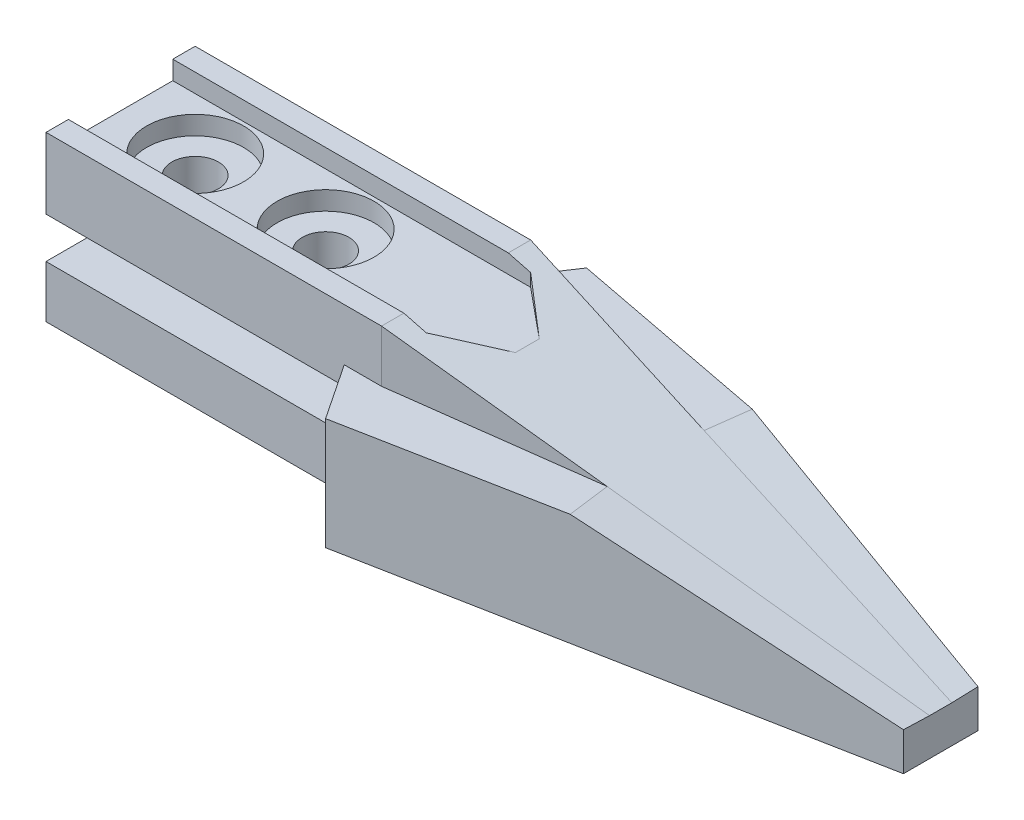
from build123d import *

# Parameters (mm, degrees)
EXTRUDE_1_DEPTH     = 20
CUT_EXTRUDE_1_DEPTH = 5
SKETCH_3_R          = 6.25
CUT_EXTRUDE_2_DEPTH = 225.323427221
SKETCH_4_R          = 13
CUT_EXTRUDE_3_DEPTH = 5
CUT_EXTRUDE_START   = -5
SKETCH_5_R          = 13
CUT_EXTRUDE_4_DEPTH = 5
CUT_EXTRUDE_6_DEPTH = 226.246531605
EXTRUDE_2_DEPTH     = 30
CUT_EXTRUDE_7_DEPTH = 227.231075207


with BuildPart() as part:
    # Sketch 1 → Extrude 1 (new, symmetric)
    with BuildSketch(Plane.XY):
        Polygon((0, 0), (90, 0), (220, -34), (220, -44), (0, -44), (0, -30), (80, -30), (80, -19), (0, -19), align=None)
    extrude(amount=EXTRUDE_1_DEPTH, both=True)

    # Sketch 2 → Cut-Extrude 1 (cut)
    with BuildSketch(Plane(origin=(0, 0, 0), x_dir=(-1, 0, 0), z_dir=(0, 1, 0))):
        Polygon((0, -14), (-96, -14), (-113, 0), (-96, 14), (0, 14), align=None)
    extrude(amount=-CUT_EXTRUDE_1_DEPTH, mode=Mode.SUBTRACT)

    # Sketch 3 → Cut-Extrude 2 (cut, through all)
    with BuildSketch(Plane(origin=(0, -5, 0), x_dir=(-1, 0, 0), z_dir=(0, 1, 0))):
        with Locations(Location((-20, 0, 0), (0, 0, 90))):
            Circle(SKETCH_3_R)
        with Locations(Location((-55, 0, 0), (0, 0, 90))):
            Circle(SKETCH_3_R)
    extrude(amount=-CUT_EXTRUDE_2_DEPTH, mode=Mode.SUBTRACT)

    # Sketch 4 → Cut-Extrude 3 (cut)
    with BuildSketch(Plane(origin=(0, -5, 0), x_dir=(-1, 0, 0), z_dir=(0, 1, 0))):
        with Locations(Location((-55, 0, 0), (0, 0, 90))):
            Circle(SKETCH_4_R)
        with Locations(Location((-20, 0, 0), (0, 0, 90))):
            Circle(SKETCH_4_R)
    extrude(amount=-CUT_EXTRUDE_3_DEPTH, mode=Mode.SUBTRACT)

    # Sketch 5 → Cut-Extrude 4 (cut)
    with BuildSketch(Plane.XZ.offset(44).offset(CUT_EXTRUDE_START)):
        with Locations(Location((20, 0, 0), (0, 0, 90))):
            Circle(SKETCH_5_R)
        with Locations(Location((55, 0, 0), (0, 0, 90))):
            Circle(SKETCH_5_R)
    extrude(amount=CUT_EXTRUDE_4_DEPTH, mode=Mode.SUBTRACT)

    # Sketch 8 → Cut-Extrude 6 (cut, through all)
    with BuildSketch(Plane(origin=(0, 0, 0), x_dir=(-1, 0, 0), z_dir=(0, 1, 0))):
        Polygon((-90, -20), (-220, -3), (-220, -20), align=None)
        Polygon((-90, 20), (-220, 20), (-220, 3), align=None)
    extrude(amount=-CUT_EXTRUDE_6_DEPTH, mode=Mode.SUBTRACT)

    # Sketch 9 → Extrude 2 (add)
    with BuildSketch(Plane.XZ.offset(44)):
        Polygon((80, -20), (90, -35), (220, -10), (220, -3), (90, -20), align=None)
    extrude_2 = extrude(amount=-EXTRUDE_2_DEPTH)

    # Sketch 10 → Cut-Extrude 7 (cut, through all)
    with BuildSketch(Plane(origin=(4.084588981, 0, -31.23509221), x_dir=(0.9915578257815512, 0, 0.1296652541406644), z_dir=(-0.1296652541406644, 0, 0.9915578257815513))):
        Polygon((140.632063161, -14), (217.75372591, -34), (217.75372591, -14), align=None)
    cut_extrude_7 = extrude(amount=-CUT_EXTRUDE_7_DEPTH, mode=Mode.SUBTRACT)

    # Mirror 1: Extrude 2, Cut-Extrude 7 across plane
    add(extrude_2.mirror(Plane.XY))
    add(cut_extrude_7.mirror(Plane.XY), mode=Mode.SUBTRACT)


solid = part.part
